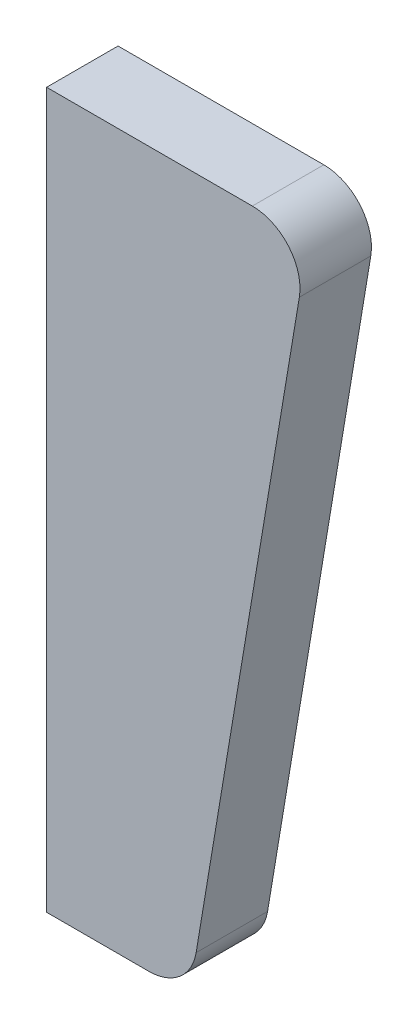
ISO-10303-21;
HEADER;
FILE_DESCRIPTION(('STEP AP214'),'2;1');
FILE_NAME('part.step','',(''),(''),'','','');
FILE_SCHEMA(('AUTOMOTIVE_DESIGN { 1 0 10303 214 1 1 1 1 }'));
ENDSEC;
DATA;
#1=APPLICATION_CONTEXT('core data for automotive mechanical design processes');
#2=APPLICATION_PROTOCOL_DEFINITION('international standard','automotive_design',2000,#1);
#3=PRODUCT_CONTEXT('',#1,'mechanical');
#4=PRODUCT('Part','Part','',(#3));
#5=PRODUCT_RELATED_PRODUCT_CATEGORY('part','',(#4));
#6=PRODUCT_DEFINITION_FORMATION('','',#4);
#7=PRODUCT_DEFINITION_CONTEXT('part definition',#1,'design');
#8=PRODUCT_DEFINITION('design','',#6,#7);
#9=PRODUCT_DEFINITION_SHAPE('','',#8);
#10=(LENGTH_UNIT() NAMED_UNIT(*) SI_UNIT(.MILLI.,.METRE.));
#11=(NAMED_UNIT(*) PLANE_ANGLE_UNIT() SI_UNIT($,.RADIAN.));
#12=(NAMED_UNIT(*) SI_UNIT($,.STERADIAN.) SOLID_ANGLE_UNIT());
#13=UNCERTAINTY_MEASURE_WITH_UNIT(LENGTH_MEASURE(1.E-05),#10,'distance_accuracy_value','');
#14=(GEOMETRIC_REPRESENTATION_CONTEXT(3) GLOBAL_UNCERTAINTY_ASSIGNED_CONTEXT((#13)) GLOBAL_UNIT_ASSIGNED_CONTEXT((#10,
#11,#12)) REPRESENTATION_CONTEXT('',''));
#15=CARTESIAN_POINT('',(0.,0.,0.));
#16=DIRECTION('',(0.,0.,1.));
#17=DIRECTION('',(1.,0.,0.));
#18=AXIS2_PLACEMENT_3D('',#15,#16,#17);
#19=CARTESIAN_POINT('',(-1.55493919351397,-2.34862385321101,3.));
#20=DIRECTION('',(1.,0.,0.));
#21=DIRECTION('',(0.,1.,0.));
#22=AXIS2_PLACEMENT_3D('',#19,#20,#21);
#23=PLANE('',#22);
#24=DIRECTION('',(0.,-1.,0.));
#25=VECTOR('',#24,1.);
#26=CARTESIAN_POINT('',(-1.55493919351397,-2.34862385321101,0.));
#27=LINE('',#26,#25);
#28=CARTESIAN_POINT('',(-1.55493919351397,-2.34862385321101,0.));
#29=VERTEX_POINT('',#28);
#30=CARTESIAN_POINT('',(-1.55493919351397,-32.348623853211,0.));
#31=VERTEX_POINT('',#30);
#32=EDGE_CURVE('E118',#29,#31,#27,.T.);
#33=ORIENTED_EDGE('',*,*,#32,.T.);
#34=DIRECTION('',(0.,0.,-1.));
#35=VECTOR('',#34,1.);
#36=CARTESIAN_POINT('',(-1.55493919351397,-32.348623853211,3.));
#37=LINE('',#36,#35);
#38=CARTESIAN_POINT('',(-1.55493919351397,-32.348623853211,3.));
#39=VERTEX_POINT('',#38);
#40=EDGE_CURVE('E11',#39,#31,#37,.T.);
#41=ORIENTED_EDGE('',*,*,#40,.F.);
#42=DIRECTION('',(0.,-1.,0.));
#43=VECTOR('',#42,1.);
#44=CARTESIAN_POINT('',(-1.55493919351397,-2.34862385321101,3.));
#45=LINE('',#44,#43);
#46=CARTESIAN_POINT('',(-1.55493919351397,-2.34862385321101,3.));
#47=VERTEX_POINT('',#46);
#48=EDGE_CURVE('E129',#47,#39,#45,.T.);
#49=ORIENTED_EDGE('',*,*,#48,.F.);
#50=DIRECTION('',(0.,0.,-1.));
#51=VECTOR('',#50,1.);
#52=CARTESIAN_POINT('',(-1.55493919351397,-2.34862385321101,3.));
#53=LINE('',#52,#51);
#54=EDGE_CURVE('E114',#47,#29,#53,.T.);
#55=ORIENTED_EDGE('',*,*,#54,.T.);
#56=EDGE_LOOP('',(#33,#41,#49,#55));
#57=FACE_BOUND('',#56,.T.);
#58=ADVANCED_FACE('F33',(#57),#23,.F.);
#59=CARTESIAN_POINT('',(-1.55493919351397,-32.348623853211,3.));
#60=DIRECTION('',(0.,1.,0.));
#61=DIRECTION('',(0.,0.,1.));
#62=AXIS2_PLACEMENT_3D('',#59,#60,#61);
#63=PLANE('',#62);
#64=DIRECTION('',(1.,0.,0.));
#65=VECTOR('',#64,1.);
#66=CARTESIAN_POINT('',(-1.55493919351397,-32.348623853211,0.));
#67=LINE('',#66,#65);
#68=CARTESIAN_POINT('',(2.75080662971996,-32.348623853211,0.));
#69=VERTEX_POINT('',#68);
#70=EDGE_CURVE('E121',#31,#69,#67,.T.);
#71=ORIENTED_EDGE('',*,*,#70,.T.);
#72=DIRECTION('',(0.,0.,-1.));
#73=VECTOR('',#72,1.);
#74=CARTESIAN_POINT('',(2.75080662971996,-32.348623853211,3.));
#75=LINE('',#74,#73);
#76=CARTESIAN_POINT('',(2.75080662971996,-32.348623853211,3.));
#77=VERTEX_POINT('',#76);
#78=EDGE_CURVE('E41',#77,#69,#75,.T.);
#79=ORIENTED_EDGE('',*,*,#78,.F.);
#80=DIRECTION('',(1.,0.,0.));
#81=VECTOR('',#80,1.);
#82=CARTESIAN_POINT('',(-1.55493919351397,-32.348623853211,3.));
#83=LINE('',#82,#81);
#84=EDGE_CURVE('E84',#39,#77,#83,.T.);
#85=ORIENTED_EDGE('',*,*,#84,.F.);
#86=ORIENTED_EDGE('',*,*,#40,.T.);
#87=EDGE_LOOP('',(#71,#79,#85,#86));
#88=FACE_BOUND('',#87,.T.);
#89=ADVANCED_FACE('F143',(#88),#63,.F.);
#90=CARTESIAN_POINT('',(2.75080662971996,-30.348623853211,3.));
#91=DIRECTION('',(0.,0.,-1.));
#92=DIRECTION('',(-1.,0.,0.));
#93=AXIS2_PLACEMENT_3D('',#90,#91,#92);
#94=CYLINDRICAL_SURFACE('',#93,2.);
#95=CARTESIAN_POINT('',(2.75080662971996,-30.348623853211,0.));
#96=DIRECTION('',(0.,0.,1.));
#97=DIRECTION('',(1.,0.,0.));
#98=AXIS2_PLACEMENT_3D('',#95,#96,#97);
#99=CIRCLE('',#98,2.);
#100=CARTESIAN_POINT('',(4.72359447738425,-30.6774218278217,0.));
#101=VERTEX_POINT('',#100);
#102=EDGE_CURVE('E123',#69,#101,#99,.T.);
#103=ORIENTED_EDGE('',*,*,#102,.T.);
#104=DIRECTION('',(0.,0.,-1.));
#105=VECTOR('',#104,1.);
#106=CARTESIAN_POINT('',(4.72359447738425,-30.6774218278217,3.));
#107=LINE('',#106,#105);
#108=CARTESIAN_POINT('',(4.72359447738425,-30.6774218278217,3.));
#109=VERTEX_POINT('',#108);
#110=EDGE_CURVE('E109',#109,#101,#107,.T.);
#111=ORIENTED_EDGE('',*,*,#110,.F.);
#112=CARTESIAN_POINT('',(2.75080662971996,-30.348623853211,3.));
#113=DIRECTION('',(0.,0.,1.));
#114=DIRECTION('',(1.,0.,0.));
#115=AXIS2_PLACEMENT_3D('',#112,#113,#114);
#116=CIRCLE('',#115,2.);
#117=EDGE_CURVE('E98',#77,#109,#116,.T.);
#118=ORIENTED_EDGE('',*,*,#117,.F.);
#119=ORIENTED_EDGE('',*,*,#78,.T.);
#120=EDGE_LOOP('',(#103,#111,#118,#119));
#121=FACE_BOUND('',#120,.T.);
#122=ADVANCED_FACE('F135',(#121),#94,.T.);
#123=CARTESIAN_POINT('',(4.72359447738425,-30.6774218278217,3.));
#124=DIRECTION('',(-0.986393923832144,0.164398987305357,0.));
#125=DIRECTION('',(-0.164398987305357,-0.986393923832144,0.));
#126=AXIS2_PLACEMENT_3D('',#123,#124,#125);
#127=PLANE('',#126);
#128=DIRECTION('',(0.164398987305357,0.986393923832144,0.));
#129=VECTOR('',#128,1.);
#130=CARTESIAN_POINT('',(4.72359447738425,-30.6774218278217,0.));
#131=LINE('',#130,#129);
#132=CARTESIAN_POINT('',(9.05692781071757,-4.67742182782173,0.));
#133=VERTEX_POINT('',#132);
#134=EDGE_CURVE('E107',#101,#133,#131,.T.);
#135=ORIENTED_EDGE('',*,*,#134,.T.);
#136=DIRECTION('',(0.,0.,-1.));
#137=VECTOR('',#136,1.);
#138=CARTESIAN_POINT('',(9.05692781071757,-4.67742182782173,3.));
#139=LINE('',#138,#137);
#140=CARTESIAN_POINT('',(9.05692781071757,-4.67742182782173,3.));
#141=VERTEX_POINT('',#140);
#142=EDGE_CURVE('E104',#141,#133,#139,.T.);
#143=ORIENTED_EDGE('',*,*,#142,.F.);
#144=DIRECTION('',(0.164398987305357,0.986393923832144,0.));
#145=VECTOR('',#144,1.);
#146=CARTESIAN_POINT('',(4.72359447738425,-30.6774218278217,3.));
#147=LINE('',#146,#145);
#148=EDGE_CURVE('E91',#109,#141,#147,.T.);
#149=ORIENTED_EDGE('',*,*,#148,.F.);
#150=ORIENTED_EDGE('',*,*,#110,.T.);
#151=EDGE_LOOP('',(#135,#143,#149,#150));
#152=FACE_BOUND('',#151,.T.);
#153=ADVANCED_FACE('F105',(#152),#127,.F.);
#154=CARTESIAN_POINT('',(7.08413996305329,-4.34862385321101,3.));
#155=DIRECTION('',(0.,0.,-1.));
#156=DIRECTION('',(-1.,0.,0.));
#157=AXIS2_PLACEMENT_3D('',#154,#155,#156);
#158=CYLINDRICAL_SURFACE('',#157,2.);
#159=CARTESIAN_POINT('',(7.08413996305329,-4.34862385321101,0.));
#160=DIRECTION('',(0.,0.,1.));
#161=DIRECTION('',(1.,0.,0.));
#162=AXIS2_PLACEMENT_3D('',#159,#160,#161);
#163=CIRCLE('',#162,2.);
#164=CARTESIAN_POINT('',(7.08413996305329,-2.34862385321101,0.));
#165=VERTEX_POINT('',#164);
#166=EDGE_CURVE('E126',#133,#165,#163,.T.);
#167=ORIENTED_EDGE('',*,*,#166,.T.);
#168=DIRECTION('',(0.,0.,-1.));
#169=VECTOR('',#168,1.);
#170=CARTESIAN_POINT('',(7.08413996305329,-2.34862385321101,3.));
#171=LINE('',#170,#169);
#172=CARTESIAN_POINT('',(7.08413996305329,-2.34862385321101,3.));
#173=VERTEX_POINT('',#172);
#174=EDGE_CURVE('E110',#173,#165,#171,.T.);
#175=ORIENTED_EDGE('',*,*,#174,.F.);
#176=CARTESIAN_POINT('',(7.08413996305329,-4.34862385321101,3.));
#177=DIRECTION('',(0.,0.,1.));
#178=DIRECTION('',(1.,0.,0.));
#179=AXIS2_PLACEMENT_3D('',#176,#177,#178);
#180=CIRCLE('',#179,2.);
#181=EDGE_CURVE('E95',#141,#173,#180,.T.);
#182=ORIENTED_EDGE('',*,*,#181,.F.);
#183=ORIENTED_EDGE('',*,*,#142,.T.);
#184=EDGE_LOOP('',(#167,#175,#182,#183));
#185=FACE_BOUND('',#184,.T.);
#186=ADVANCED_FACE('F112',(#185),#158,.T.);
#187=CARTESIAN_POINT('',(-1.55493919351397,-2.34862385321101,3.));
#188=DIRECTION('',(0.,-1.,0.));
#189=DIRECTION('',(0.,0.,-1.));
#190=AXIS2_PLACEMENT_3D('',#187,#188,#189);
#191=PLANE('',#190);
#192=DIRECTION('',(-1.,0.,0.));
#193=VECTOR('',#192,1.);
#194=CARTESIAN_POINT('',(-1.55493919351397,-2.34862385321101,0.));
#195=LINE('',#194,#193);
#196=EDGE_CURVE('E72',#165,#29,#195,.T.);
#197=ORIENTED_EDGE('',*,*,#196,.T.);
#198=ORIENTED_EDGE('',*,*,#54,.F.);
#199=DIRECTION('',(-1.,0.,0.));
#200=VECTOR('',#199,1.);
#201=CARTESIAN_POINT('',(7.08413996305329,-2.34862385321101,3.));
#202=LINE('',#201,#200);
#203=EDGE_CURVE('E49',#173,#47,#202,.T.);
#204=ORIENTED_EDGE('',*,*,#203,.F.);
#205=ORIENTED_EDGE('',*,*,#174,.T.);
#206=EDGE_LOOP('',(#197,#198,#204,#205));
#207=FACE_BOUND('',#206,.T.);
#208=ADVANCED_FACE('F137',(#207),#191,.F.);
#209=CARTESIAN_POINT('',(2.75080662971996,-30.348623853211,3.));
#210=DIRECTION('',(0.,0.,1.));
#211=DIRECTION('',(1.,0.,0.));
#212=AXIS2_PLACEMENT_3D('',#209,#210,#211);
#213=PLANE('',#212);
#214=ORIENTED_EDGE('',*,*,#48,.T.);
#215=ORIENTED_EDGE('',*,*,#84,.T.);
#216=ORIENTED_EDGE('',*,*,#117,.T.);
#217=ORIENTED_EDGE('',*,*,#148,.T.);
#218=ORIENTED_EDGE('',*,*,#181,.T.);
#219=ORIENTED_EDGE('',*,*,#203,.T.);
#220=EDGE_LOOP('',(#214,#215,#216,#217,#218,#219));
#221=FACE_BOUND('',#220,.T.);
#222=ADVANCED_FACE('F93',(#221),#213,.T.);
#223=CARTESIAN_POINT('',(2.75080662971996,-30.348623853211,0.));
#224=DIRECTION('',(0.,0.,1.));
#225=DIRECTION('',(1.,0.,0.));
#226=AXIS2_PLACEMENT_3D('',#223,#224,#225);
#227=PLANE('',#226);
#228=ORIENTED_EDGE('',*,*,#32,.F.);
#229=ORIENTED_EDGE('',*,*,#196,.F.);
#230=ORIENTED_EDGE('',*,*,#166,.F.);
#231=ORIENTED_EDGE('',*,*,#134,.F.);
#232=ORIENTED_EDGE('',*,*,#102,.F.);
#233=ORIENTED_EDGE('',*,*,#70,.F.);
#234=EDGE_LOOP('',(#228,#229,#230,#231,#232,#233));
#235=FACE_BOUND('',#234,.T.);
#236=ADVANCED_FACE('F136',(#235),#227,.F.);
#237=CLOSED_SHELL('',(#58,#89,#122,#153,#186,#208,#222,#236));
#238=MANIFOLD_SOLID_BREP('B2',#237);
#239=ADVANCED_BREP_SHAPE_REPRESENTATION('',(#18,#238),#14);
#240=SHAPE_DEFINITION_REPRESENTATION(#9,#239);
ENDSEC;
END-ISO-10303-21;
